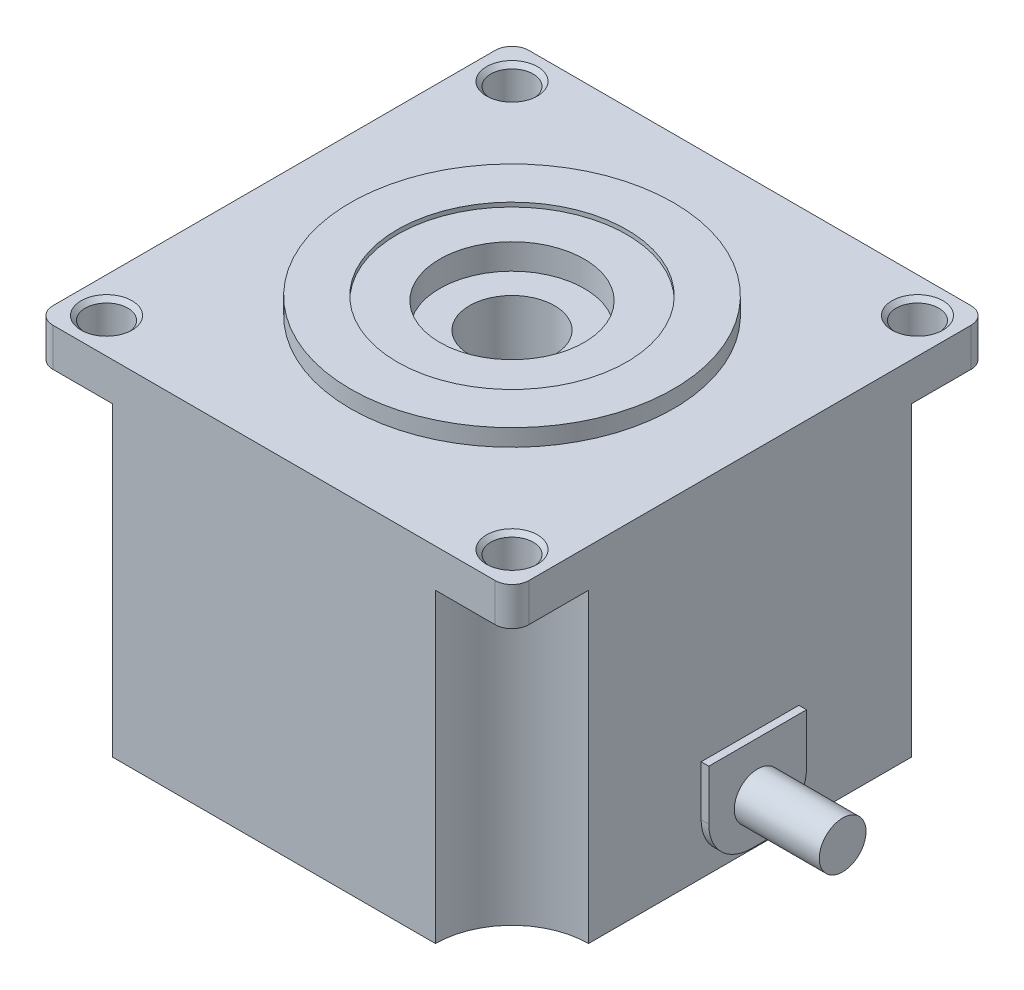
ISO-10303-21;
HEADER;
FILE_DESCRIPTION(('STEP AP214'),'2;1');
FILE_NAME('part.step','',(''),(''),'','','');
FILE_SCHEMA(('AUTOMOTIVE_DESIGN { 1 0 10303 214 1 1 1 1 }'));
ENDSEC;
DATA;
#1=APPLICATION_CONTEXT('core data for automotive mechanical design processes');
#2=APPLICATION_PROTOCOL_DEFINITION('international standard','automotive_design',2000,#1);
#3=PRODUCT_CONTEXT('',#1,'mechanical');
#4=PRODUCT('Part','Part','',(#3));
#5=PRODUCT_RELATED_PRODUCT_CATEGORY('part','',(#4));
#6=PRODUCT_DEFINITION_FORMATION('','',#4);
#7=PRODUCT_DEFINITION_CONTEXT('part definition',#1,'design');
#8=PRODUCT_DEFINITION('design','',#6,#7);
#9=PRODUCT_DEFINITION_SHAPE('','',#8);
#10=(LENGTH_UNIT() NAMED_UNIT(*) SI_UNIT(.MILLI.,.METRE.));
#11=(NAMED_UNIT(*) PLANE_ANGLE_UNIT() SI_UNIT($,.RADIAN.));
#12=(NAMED_UNIT(*) SI_UNIT($,.STERADIAN.) SOLID_ANGLE_UNIT());
#13=UNCERTAINTY_MEASURE_WITH_UNIT(LENGTH_MEASURE(1.E-05),#10,'distance_accuracy_value','');
#14=(GEOMETRIC_REPRESENTATION_CONTEXT(3) GLOBAL_UNCERTAINTY_ASSIGNED_CONTEXT((#13)) GLOBAL_UNIT_ASSIGNED_CONTEXT((#10,
#11,#12)) REPRESENTATION_CONTEXT('',''));
#15=CARTESIAN_POINT('',(0.,0.,0.));
#16=DIRECTION('',(0.,0.,1.));
#17=DIRECTION('',(1.,0.,0.));
#18=AXIS2_PLACEMENT_3D('',#15,#16,#17);
#19=CARTESIAN_POINT('',(28.8999999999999,6.00000000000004,-5.75));
#20=DIRECTION('',(0.,0.,1.));
#21=DIRECTION('',(0.,-1.,0.));
#22=AXIS2_PLACEMENT_3D('',#19,#20,#21);
#23=PLANE('',#22);
#24=DIRECTION('',(0.,1.,0.));
#25=VECTOR('',#24,1.);
#26=CARTESIAN_POINT('',(27.9999999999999,6.00000000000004,-5.75));
#27=LINE('',#26,#25);
#28=CARTESIAN_POINT('',(27.9999999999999,6.,-5.75));
#29=VERTEX_POINT('',#28);
#30=CARTESIAN_POINT('',(27.9999999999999,11.9,-5.75));
#31=VERTEX_POINT('',#30);
#32=EDGE_CURVE('E132',#29,#31,#27,.T.);
#33=ORIENTED_EDGE('',*,*,#32,.T.);
#34=DIRECTION('',(-1.,0.,0.));
#35=VECTOR('',#34,1.);
#36=CARTESIAN_POINT('',(28.8999999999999,11.9,-5.75));
#37=LINE('',#36,#35);
#38=CARTESIAN_POINT('',(28.8999999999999,11.9,-5.75));
#39=VERTEX_POINT('',#38);
#40=EDGE_CURVE('E55',#39,#31,#37,.T.);
#41=ORIENTED_EDGE('',*,*,#40,.F.);
#42=DIRECTION('',(0.,1.,0.));
#43=VECTOR('',#42,1.);
#44=CARTESIAN_POINT('',(28.8999999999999,6.00000000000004,-5.75));
#45=LINE('',#44,#43);
#46=CARTESIAN_POINT('',(28.8999999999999,6.,-5.75));
#47=VERTEX_POINT('',#46);
#48=EDGE_CURVE('E143',#47,#39,#45,.T.);
#49=ORIENTED_EDGE('',*,*,#48,.F.);
#50=DIRECTION('',(-1.,0.,0.));
#51=VECTOR('',#50,1.);
#52=CARTESIAN_POINT('',(28.8999999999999,6.,-5.75));
#53=LINE('',#52,#51);
#54=EDGE_CURVE('E128',#47,#29,#53,.T.);
#55=ORIENTED_EDGE('',*,*,#54,.T.);
#56=EDGE_LOOP('',(#33,#41,#49,#55));
#57=FACE_BOUND('',#56,.T.);
#58=ADVANCED_FACE('F47',(#57),#23,.F.);
#59=CARTESIAN_POINT('',(28.8999999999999,11.9,5.75));
#60=DIRECTION('',(0.,-1.,0.));
#61=DIRECTION('',(0.,0.,-1.));
#62=AXIS2_PLACEMENT_3D('',#59,#60,#61);
#63=PLANE('',#62);
#64=DIRECTION('',(0.,0.,1.));
#65=VECTOR('',#64,1.);
#66=CARTESIAN_POINT('',(27.9999999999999,11.9,5.75));
#67=LINE('',#66,#65);
#68=CARTESIAN_POINT('',(27.9999999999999,11.9,5.75));
#69=VERTEX_POINT('',#68);
#70=EDGE_CURVE('E135',#31,#69,#67,.T.);
#71=ORIENTED_EDGE('',*,*,#70,.T.);
#72=DIRECTION('',(-1.,0.,0.));
#73=VECTOR('',#72,1.);
#74=CARTESIAN_POINT('',(28.8999999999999,11.9,5.75));
#75=LINE('',#74,#73);
#76=CARTESIAN_POINT('',(28.8999999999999,11.9,5.75));
#77=VERTEX_POINT('',#76);
#78=EDGE_CURVE('E147',#77,#69,#75,.T.);
#79=ORIENTED_EDGE('',*,*,#78,.F.);
#80=DIRECTION('',(0.,0.,1.));
#81=VECTOR('',#80,1.);
#82=CARTESIAN_POINT('',(28.8999999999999,11.9,5.75));
#83=LINE('',#82,#81);
#84=EDGE_CURVE('E101',#39,#77,#83,.T.);
#85=ORIENTED_EDGE('',*,*,#84,.F.);
#86=ORIENTED_EDGE('',*,*,#40,.T.);
#87=EDGE_LOOP('',(#71,#79,#85,#86));
#88=FACE_BOUND('',#87,.T.);
#89=ADVANCED_FACE('F150',(#88),#63,.F.);
#90=CARTESIAN_POINT('',(28.8999999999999,6.00000000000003,5.75));
#91=DIRECTION('',(0.,0.,-1.));
#92=DIRECTION('',(0.,1.,0.));
#93=AXIS2_PLACEMENT_3D('',#90,#91,#92);
#94=PLANE('',#93);
#95=DIRECTION('',(0.,-1.,0.));
#96=VECTOR('',#95,1.);
#97=CARTESIAN_POINT('',(27.9999999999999,6.00000000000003,5.75));
#98=LINE('',#97,#96);
#99=CARTESIAN_POINT('',(27.9999999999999,6.00000000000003,5.75));
#100=VERTEX_POINT('',#99);
#101=EDGE_CURVE('E138',#69,#100,#98,.T.);
#102=ORIENTED_EDGE('',*,*,#101,.T.);
#103=DIRECTION('',(-1.,0.,0.));
#104=VECTOR('',#103,1.);
#105=CARTESIAN_POINT('',(28.8999999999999,6.00000000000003,5.75));
#106=LINE('',#105,#104);
#107=CARTESIAN_POINT('',(28.8999999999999,6.00000000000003,5.75));
#108=VERTEX_POINT('',#107);
#109=EDGE_CURVE('E123',#108,#100,#106,.T.);
#110=ORIENTED_EDGE('',*,*,#109,.F.);
#111=DIRECTION('',(0.,-1.,0.));
#112=VECTOR('',#111,1.);
#113=CARTESIAN_POINT('',(28.8999999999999,6.00000000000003,5.75));
#114=LINE('',#113,#112);
#115=EDGE_CURVE('E114',#77,#108,#114,.T.);
#116=ORIENTED_EDGE('',*,*,#115,.F.);
#117=ORIENTED_EDGE('',*,*,#78,.T.);
#118=EDGE_LOOP('',(#102,#110,#116,#117));
#119=FACE_BOUND('',#118,.T.);
#120=ADVANCED_FACE('F158',(#119),#94,.F.);
#121=CARTESIAN_POINT('',(28.8999999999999,6.,0.749999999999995));
#122=DIRECTION('',(-1.,0.,0.));
#123=DIRECTION('',(0.,0.,1.));
#124=AXIS2_PLACEMENT_3D('',#121,#122,#123);
#125=CYLINDRICAL_SURFACE('',#124,5.);
#126=CARTESIAN_POINT('',(27.9999999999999,6.,0.749999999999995));
#127=DIRECTION('',(1.,0.,0.));
#128=DIRECTION('',(0.,0.,1.));
#129=AXIS2_PLACEMENT_3D('',#126,#127,#128);
#130=CIRCLE('',#129,5.);
#131=CARTESIAN_POINT('',(27.9999999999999,1.,0.749999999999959));
#132=VERTEX_POINT('',#131);
#133=EDGE_CURVE('E122',#100,#132,#130,.T.);
#134=ORIENTED_EDGE('',*,*,#133,.T.);
#135=DIRECTION('',(-1.,0.,0.));
#136=VECTOR('',#135,1.);
#137=CARTESIAN_POINT('',(28.8999999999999,1.,0.749999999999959));
#138=LINE('',#137,#136);
#139=CARTESIAN_POINT('',(28.8999999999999,1.,0.749999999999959));
#140=VERTEX_POINT('',#139);
#141=EDGE_CURVE('E119',#140,#132,#138,.T.);
#142=ORIENTED_EDGE('',*,*,#141,.F.);
#143=CARTESIAN_POINT('',(28.8999999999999,6.,0.749999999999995));
#144=DIRECTION('',(1.,0.,0.));
#145=DIRECTION('',(0.,0.,1.));
#146=AXIS2_PLACEMENT_3D('',#143,#144,#145);
#147=CIRCLE('',#146,5.);
#148=EDGE_CURVE('E108',#108,#140,#147,.T.);
#149=ORIENTED_EDGE('',*,*,#148,.F.);
#150=ORIENTED_EDGE('',*,*,#109,.T.);
#151=EDGE_LOOP('',(#134,#142,#149,#150));
#152=FACE_BOUND('',#151,.T.);
#153=ADVANCED_FACE('F120',(#152),#125,.T.);
#154=CARTESIAN_POINT('',(28.8999999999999,1.,0.74999999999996));
#155=DIRECTION('',(0.,1.,0.));
#156=DIRECTION('',(0.,0.,1.));
#157=AXIS2_PLACEMENT_3D('',#154,#155,#156);
#158=PLANE('',#157);
#159=DIRECTION('',(0.,0.,-1.));
#160=VECTOR('',#159,1.);
#161=CARTESIAN_POINT('',(27.9999999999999,1.,0.74999999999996));
#162=LINE('',#161,#160);
#163=CARTESIAN_POINT('',(27.9999999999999,1.,-0.749999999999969));
#164=VERTEX_POINT('',#163);
#165=EDGE_CURVE('E86',#132,#164,#162,.T.);
#166=ORIENTED_EDGE('',*,*,#165,.T.);
#167=DIRECTION('',(-1.,0.,0.));
#168=VECTOR('',#167,1.);
#169=CARTESIAN_POINT('',(28.8999999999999,1.,-0.74999999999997));
#170=LINE('',#169,#168);
#171=CARTESIAN_POINT('',(28.8999999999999,1.,-0.74999999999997));
#172=VERTEX_POINT('',#171);
#173=EDGE_CURVE('E124',#172,#164,#170,.T.);
#174=ORIENTED_EDGE('',*,*,#173,.F.);
#175=DIRECTION('',(0.,0.,-1.));
#176=VECTOR('',#175,1.);
#177=CARTESIAN_POINT('',(28.8999999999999,1.,0.74999999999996));
#178=LINE('',#177,#176);
#179=EDGE_CURVE('E112',#140,#172,#178,.T.);
#180=ORIENTED_EDGE('',*,*,#179,.F.);
#181=ORIENTED_EDGE('',*,*,#141,.T.);
#182=EDGE_LOOP('',(#166,#174,#180,#181));
#183=FACE_BOUND('',#182,.T.);
#184=ADVANCED_FACE('F126',(#183),#158,.F.);
#185=CARTESIAN_POINT('',(28.8999999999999,6.,-0.750000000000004));
#186=DIRECTION('',(-1.,0.,0.));
#187=DIRECTION('',(0.,0.,1.));
#188=AXIS2_PLACEMENT_3D('',#185,#186,#187);
#189=CYLINDRICAL_SURFACE('',#188,5.);
#190=CARTESIAN_POINT('',(27.9999999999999,6.,-0.750000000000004));
#191=DIRECTION('',(1.,0.,0.));
#192=DIRECTION('',(0.,0.,-1.));
#193=AXIS2_PLACEMENT_3D('',#190,#191,#192);
#194=CIRCLE('',#193,5.);
#195=EDGE_CURVE('E92',#164,#29,#194,.T.);
#196=ORIENTED_EDGE('',*,*,#195,.T.);
#197=ORIENTED_EDGE('',*,*,#54,.F.);
#198=CARTESIAN_POINT('',(28.8999999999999,6.,-0.750000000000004));
#199=DIRECTION('',(1.,0.,0.));
#200=DIRECTION('',(0.,0.,-1.));
#201=AXIS2_PLACEMENT_3D('',#198,#199,#200);
#202=CIRCLE('',#201,5.);
#203=EDGE_CURVE('E63',#172,#47,#202,.T.);
#204=ORIENTED_EDGE('',*,*,#203,.F.);
#205=ORIENTED_EDGE('',*,*,#173,.T.);
#206=EDGE_LOOP('',(#196,#197,#204,#205));
#207=FACE_BOUND('',#206,.T.);
#208=ADVANCED_FACE('F174',(#207),#189,.T.);
#209=CARTESIAN_POINT('',(28.8999999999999,6.,0.749999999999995));
#210=DIRECTION('',(-1.,0.,0.));
#211=DIRECTION('',(0.,0.,1.));
#212=AXIS2_PLACEMENT_3D('',#209,#210,#211);
#213=PLANE('',#212);
#214=CARTESIAN_POINT('',(28.8999999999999,6.,0.));
#215=DIRECTION('',(-1.,0.,0.));
#216=DIRECTION('',(0.,0.,1.));
#217=AXIS2_PLACEMENT_3D('',#214,#215,#216);
#218=CIRCLE('',#217,2.75);
#219=CARTESIAN_POINT('',(28.8999999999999,6.,2.75));
#220=VERTEX_POINT('',#219);
#221=EDGE_CURVE('E12',#220,#220,#218,.F.);
#222=ORIENTED_EDGE('',*,*,#221,.F.);
#223=EDGE_LOOP('',(#222));
#224=FACE_BOUND('',#223,.T.);
#225=ORIENTED_EDGE('',*,*,#48,.T.);
#226=ORIENTED_EDGE('',*,*,#84,.T.);
#227=ORIENTED_EDGE('',*,*,#115,.T.);
#228=ORIENTED_EDGE('',*,*,#148,.T.);
#229=ORIENTED_EDGE('',*,*,#179,.T.);
#230=ORIENTED_EDGE('',*,*,#203,.T.);
#231=EDGE_LOOP('',(#225,#226,#227,#228,#229,#230));
#232=FACE_BOUND('',#231,.T.);
#233=ADVANCED_FACE('F110',(#224,#232),#213,.F.);
#234=CARTESIAN_POINT('',(27.9999999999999,6.,0.749999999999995));
#235=DIRECTION('',(-1.,0.,0.));
#236=DIRECTION('',(0.,0.,1.));
#237=AXIS2_PLACEMENT_3D('',#234,#235,#236);
#238=PLANE('',#237);
#239=ORIENTED_EDGE('',*,*,#32,.F.);
#240=ORIENTED_EDGE('',*,*,#195,.F.);
#241=ORIENTED_EDGE('',*,*,#165,.F.);
#242=ORIENTED_EDGE('',*,*,#133,.F.);
#243=ORIENTED_EDGE('',*,*,#101,.F.);
#244=ORIENTED_EDGE('',*,*,#70,.F.);
#245=EDGE_LOOP('',(#239,#240,#241,#242,#243,#244));
#246=FACE_BOUND('',#245,.T.);
#247=ADVANCED_FACE('F155',(#246),#238,.T.);
#248=CARTESIAN_POINT('',(38.8999999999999,6.,0.));
#249=DIRECTION('',(-1.,0.,0.));
#250=DIRECTION('',(0.,0.,1.));
#251=AXIS2_PLACEMENT_3D('',#248,#249,#250);
#252=CYLINDRICAL_SURFACE('',#251,2.75);
#253=CARTESIAN_POINT('',(38.8999999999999,6.,0.));
#254=DIRECTION('',(1.,0.,0.));
#255=DIRECTION('',(0.,0.,-1.));
#256=AXIS2_PLACEMENT_3D('',#253,#254,#255);
#257=CIRCLE('',#256,2.75);
#258=CARTESIAN_POINT('',(38.8999999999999,6.,-2.75000000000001));
#259=VERTEX_POINT('',#258);
#260=EDGE_CURVE('E136',#259,#259,#257,.T.);
#261=ORIENTED_EDGE('',*,*,#260,.F.);
#262=EDGE_LOOP('',(#261));
#263=FACE_BOUND('',#262,.T.);
#264=ORIENTED_EDGE('',*,*,#221,.T.);
#265=EDGE_LOOP('',(#264));
#266=FACE_BOUND('',#265,.T.);
#267=ADVANCED_FACE('F167',(#263,#266),#252,.T.);
#268=CARTESIAN_POINT('',(38.8999999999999,6.,0.));
#269=DIRECTION('',(1.,0.,0.));
#270=DIRECTION('',(0.,0.,-1.));
#271=AXIS2_PLACEMENT_3D('',#268,#269,#270);
#272=PLANE('',#271);
#273=ORIENTED_EDGE('',*,*,#260,.T.);
#274=EDGE_LOOP('',(#273));
#275=FACE_BOUND('',#274,.T.);
#276=ADVANCED_FACE('F165',(#275),#272,.T.);
#277=CLOSED_SHELL('',(#58,#89,#120,#153,#184,#208,#233,#247,#267,#276));
#278=MANIFOLD_SOLID_BREP('B2',#277);
#279=CARTESIAN_POINT('',(27.9999999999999,40.5,-28.0000000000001));
#280=DIRECTION('',(-1.,0.,0.));
#281=DIRECTION('',(0.,0.,1.));
#282=AXIS2_PLACEMENT_3D('',#279,#280,#281);
#283=PLANE('',#282);
#284=DIRECTION('',(0.,-1.,0.));
#285=VECTOR('',#284,1.);
#286=CARTESIAN_POINT('',(28.,40.5,26.));
#287=LINE('',#286,#285);
#288=CARTESIAN_POINT('',(28.,40.5,26.));
#289=VERTEX_POINT('',#288);
#290=CARTESIAN_POINT('',(28.,36.,26.));
#291=VERTEX_POINT('',#290);
#292=EDGE_CURVE('E512',#289,#291,#287,.T.);
#293=ORIENTED_EDGE('',*,*,#292,.T.);
#294=DIRECTION('',(0.,0.,1.));
#295=VECTOR('',#294,1.);
#296=CARTESIAN_POINT('',(27.9999999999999,36.,0.));
#297=LINE('',#296,#295);
#298=CARTESIAN_POINT('',(28.,36.,19.));
#299=VERTEX_POINT('',#298);
#300=EDGE_CURVE('E276',#299,#291,#297,.T.);
#301=ORIENTED_EDGE('',*,*,#300,.F.);
#302=DIRECTION('',(0.,-1.,0.));
#303=VECTOR('',#302,1.);
#304=CARTESIAN_POINT('',(28.,53.2279220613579,19.));
#305=LINE('',#304,#303);
#306=CARTESIAN_POINT('',(28.,0.,19.));
#307=VERTEX_POINT('',#306);
#308=EDGE_CURVE('E405',#299,#307,#305,.T.);
#309=ORIENTED_EDGE('',*,*,#308,.T.);
#310=DIRECTION('',(0.,0.,-1.));
#311=VECTOR('',#310,1.);
#312=CARTESIAN_POINT('',(27.9999999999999,0.,-28.0000000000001));
#313=LINE('',#312,#311);
#314=CARTESIAN_POINT('',(27.9999999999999,0.,-19.0000000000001));
#315=VERTEX_POINT('',#314);
#316=EDGE_CURVE('E470',#307,#315,#313,.T.);
#317=ORIENTED_EDGE('',*,*,#316,.T.);
#318=DIRECTION('',(0.,-1.,0.));
#319=VECTOR('',#318,1.);
#320=CARTESIAN_POINT('',(27.9999999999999,53.2279220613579,-19.0000000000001));
#321=LINE('',#320,#319);
#322=CARTESIAN_POINT('',(27.9999999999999,36.,-19.0000000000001));
#323=VERTEX_POINT('',#322);
#324=EDGE_CURVE('E403',#323,#315,#321,.T.);
#325=ORIENTED_EDGE('',*,*,#324,.F.);
#326=DIRECTION('',(0.,0.,1.));
#327=VECTOR('',#326,1.);
#328=CARTESIAN_POINT('',(27.9999999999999,36.,0.));
#329=LINE('',#328,#327);
#330=CARTESIAN_POINT('',(27.9999999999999,36.,-26.0000000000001));
#331=VERTEX_POINT('',#330);
#332=EDGE_CURVE('E422',#331,#323,#329,.T.);
#333=ORIENTED_EDGE('',*,*,#332,.F.);
#334=DIRECTION('',(0.,-1.,0.));
#335=VECTOR('',#334,1.);
#336=CARTESIAN_POINT('',(27.9999999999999,40.5,-26.0000000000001));
#337=LINE('',#336,#335);
#338=CARTESIAN_POINT('',(27.9999999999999,40.5,-26.0000000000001));
#339=VERTEX_POINT('',#338);
#340=EDGE_CURVE('E515',#331,#339,#337,.F.);
#341=ORIENTED_EDGE('',*,*,#340,.T.);
#342=DIRECTION('',(0.,0.,-1.));
#343=VECTOR('',#342,1.);
#344=CARTESIAN_POINT('',(27.9999999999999,40.5,-28.0000000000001));
#345=LINE('',#344,#343);
#346=EDGE_CURVE('E473',#289,#339,#345,.T.);
#347=ORIENTED_EDGE('',*,*,#346,.F.);
#348=EDGE_LOOP('',(#293,#301,#309,#317,#325,#333,#341,#347));
#349=FACE_BOUND('',#348,.T.);
#350=ADVANCED_FACE('F253',(#349),#283,.F.);
#351=CARTESIAN_POINT('',(-28.0000000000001,40.5,-28.0000000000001));
#352=DIRECTION('',(0.,0.,1.));
#353=DIRECTION('',(1.,0.,0.));
#354=AXIS2_PLACEMENT_3D('',#351,#352,#353);
#355=PLANE('',#354);
#356=DIRECTION('',(0.,-1.,0.));
#357=VECTOR('',#356,1.);
#358=CARTESIAN_POINT('',(25.9999999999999,40.5,-28.0000000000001));
#359=LINE('',#358,#357);
#360=CARTESIAN_POINT('',(25.9999999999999,40.5,-28.0000000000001));
#361=VERTEX_POINT('',#360);
#362=CARTESIAN_POINT('',(25.9999999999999,36.,-28.0000000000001));
#363=VERTEX_POINT('',#362);
#364=EDGE_CURVE('E499',#361,#363,#359,.T.);
#365=ORIENTED_EDGE('',*,*,#364,.T.);
#366=DIRECTION('',(1.,0.,0.));
#367=VECTOR('',#366,1.);
#368=CARTESIAN_POINT('',(0.,36.,-28.0000000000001));
#369=LINE('',#368,#367);
#370=CARTESIAN_POINT('',(18.9999999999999,36.,-28.0000000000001));
#371=VERTEX_POINT('',#370);
#372=EDGE_CURVE('E268',#371,#363,#369,.T.);
#373=ORIENTED_EDGE('',*,*,#372,.F.);
#374=DIRECTION('',(0.,-1.,0.));
#375=VECTOR('',#374,1.);
#376=CARTESIAN_POINT('',(18.9999999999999,53.2279220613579,-28.0000000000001));
#377=LINE('',#376,#375);
#378=CARTESIAN_POINT('',(18.9999999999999,0.,-28.0000000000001));
#379=VERTEX_POINT('',#378);
#380=EDGE_CURVE('E421',#371,#379,#377,.T.);
#381=ORIENTED_EDGE('',*,*,#380,.T.);
#382=DIRECTION('',(-1.,0.,0.));
#383=VECTOR('',#382,1.);
#384=CARTESIAN_POINT('',(-28.0000000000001,0.,-28.0000000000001));
#385=LINE('',#384,#383);
#386=CARTESIAN_POINT('',(-19.0000000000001,0.,-28.0000000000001));
#387=VERTEX_POINT('',#386);
#388=EDGE_CURVE('E489',#379,#387,#385,.T.);
#389=ORIENTED_EDGE('',*,*,#388,.T.);
#390=DIRECTION('',(0.,-1.,0.));
#391=VECTOR('',#390,1.);
#392=CARTESIAN_POINT('',(-19.0000000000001,53.2279220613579,-28.0000000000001));
#393=LINE('',#392,#391);
#394=CARTESIAN_POINT('',(-19.0000000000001,36.,-28.0000000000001));
#395=VERTEX_POINT('',#394);
#396=EDGE_CURVE('E439',#395,#387,#393,.T.);
#397=ORIENTED_EDGE('',*,*,#396,.F.);
#398=DIRECTION('',(1.,0.,0.));
#399=VECTOR('',#398,1.);
#400=CARTESIAN_POINT('',(0.,36.,-28.0000000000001));
#401=LINE('',#400,#399);
#402=CARTESIAN_POINT('',(-26.0000000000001,36.,-28.0000000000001));
#403=VERTEX_POINT('',#402);
#404=EDGE_CURVE('E436',#403,#395,#401,.T.);
#405=ORIENTED_EDGE('',*,*,#404,.F.);
#406=DIRECTION('',(0.,-1.,0.));
#407=VECTOR('',#406,1.);
#408=CARTESIAN_POINT('',(-26.0000000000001,40.5,-28.0000000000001));
#409=LINE('',#408,#407);
#410=CARTESIAN_POINT('',(-26.0000000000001,40.5,-28.0000000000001));
#411=VERTEX_POINT('',#410);
#412=EDGE_CURVE('E502',#403,#411,#409,.F.);
#413=ORIENTED_EDGE('',*,*,#412,.T.);
#414=DIRECTION('',(-1.,0.,0.));
#415=VECTOR('',#414,1.);
#416=CARTESIAN_POINT('',(-28.0000000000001,40.5,-28.0000000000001));
#417=LINE('',#416,#415);
#418=EDGE_CURVE('E476',#361,#411,#417,.T.);
#419=ORIENTED_EDGE('',*,*,#418,.F.);
#420=EDGE_LOOP('',(#365,#373,#381,#389,#397,#405,#413,#419));
#421=FACE_BOUND('',#420,.T.);
#422=ADVANCED_FACE('F555',(#421),#355,.F.);
#423=CARTESIAN_POINT('',(-28.0000000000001,40.5,-28.0000000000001));
#424=DIRECTION('',(1.,0.,0.));
#425=DIRECTION('',(0.,0.,-1.));
#426=AXIS2_PLACEMENT_3D('',#423,#424,#425);
#427=PLANE('',#426);
#428=DIRECTION('',(0.,-1.,0.));
#429=VECTOR('',#428,1.);
#430=CARTESIAN_POINT('',(-28.0000000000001,53.2279220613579,19.));
#431=LINE('',#430,#429);
#432=CARTESIAN_POINT('',(-28.0000000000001,36.,19.));
#433=VERTEX_POINT('',#432);
#434=CARTESIAN_POINT('',(-28.0000000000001,0.,19.));
#435=VERTEX_POINT('',#434);
#436=EDGE_CURVE('E397',#433,#435,#431,.T.);
#437=ORIENTED_EDGE('',*,*,#436,.F.);
#438=DIRECTION('',(0.,0.,-1.));
#439=VECTOR('',#438,1.);
#440=CARTESIAN_POINT('',(-28.0000000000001,36.,0.));
#441=LINE('',#440,#439);
#442=CARTESIAN_POINT('',(-28.0000000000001,36.,26.));
#443=VERTEX_POINT('',#442);
#444=EDGE_CURVE('E384',#443,#433,#441,.T.);
#445=ORIENTED_EDGE('',*,*,#444,.F.);
#446=DIRECTION('',(0.,-1.,0.));
#447=VECTOR('',#446,1.);
#448=CARTESIAN_POINT('',(-28.0000000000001,40.5,26.));
#449=LINE('',#448,#447);
#450=CARTESIAN_POINT('',(-28.0000000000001,40.5,26.));
#451=VERTEX_POINT('',#450);
#452=EDGE_CURVE('E486',#443,#451,#449,.F.);
#453=ORIENTED_EDGE('',*,*,#452,.T.);
#454=DIRECTION('',(0.,0.,1.));
#455=VECTOR('',#454,1.);
#456=CARTESIAN_POINT('',(-28.0000000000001,40.5,-28.0000000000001));
#457=LINE('',#456,#455);
#458=CARTESIAN_POINT('',(-28.0000000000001,40.5,-26.0000000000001));
#459=VERTEX_POINT('',#458);
#460=EDGE_CURVE('E480',#459,#451,#457,.T.);
#461=ORIENTED_EDGE('',*,*,#460,.F.);
#462=DIRECTION('',(0.,-1.,0.));
#463=VECTOR('',#462,1.);
#464=CARTESIAN_POINT('',(-28.0000000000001,40.5,-26.0000000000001));
#465=LINE('',#464,#463);
#466=CARTESIAN_POINT('',(-28.0000000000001,36.,-26.0000000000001));
#467=VERTEX_POINT('',#466);
#468=EDGE_CURVE('E496',#459,#467,#465,.T.);
#469=ORIENTED_EDGE('',*,*,#468,.T.);
#470=DIRECTION('',(0.,0.,-1.));
#471=VECTOR('',#470,1.);
#472=CARTESIAN_POINT('',(-28.0000000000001,36.,0.));
#473=LINE('',#472,#471);
#474=CARTESIAN_POINT('',(-28.0000000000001,36.,-19.0000000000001));
#475=VERTEX_POINT('',#474);
#476=EDGE_CURVE('E442',#475,#467,#473,.T.);
#477=ORIENTED_EDGE('',*,*,#476,.F.);
#478=DIRECTION('',(0.,-1.,0.));
#479=VECTOR('',#478,1.);
#480=CARTESIAN_POINT('',(-28.0000000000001,53.2279220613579,-19.0000000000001));
#481=LINE('',#480,#479);
#482=CARTESIAN_POINT('',(-28.0000000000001,0.,-19.0000000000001));
#483=VERTEX_POINT('',#482);
#484=EDGE_CURVE('E435',#475,#483,#481,.T.);
#485=ORIENTED_EDGE('',*,*,#484,.T.);
#486=DIRECTION('',(0.,0.,1.));
#487=VECTOR('',#486,1.);
#488=CARTESIAN_POINT('',(-28.0000000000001,0.,-28.0000000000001));
#489=LINE('',#488,#487);
#490=EDGE_CURVE('E491',#483,#435,#489,.T.);
#491=ORIENTED_EDGE('',*,*,#490,.T.);
#492=EDGE_LOOP('',(#437,#445,#453,#461,#469,#477,#485,#491));
#493=FACE_BOUND('',#492,.T.);
#494=ADVANCED_FACE('F561',(#493),#427,.F.);
#495=CARTESIAN_POINT('',(-28.0000000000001,40.5,28.));
#496=DIRECTION('',(0.,0.,-1.));
#497=DIRECTION('',(-1.,0.,0.));
#498=AXIS2_PLACEMENT_3D('',#495,#496,#497);
#499=PLANE('',#498);
#500=DIRECTION('',(0.,-1.,0.));
#501=VECTOR('',#500,1.);
#502=CARTESIAN_POINT('',(-26.,40.5,28.));
#503=LINE('',#502,#501);
#504=CARTESIAN_POINT('',(-26.,40.5,28.));
#505=VERTEX_POINT('',#504);
#506=CARTESIAN_POINT('',(-26.,36.,28.));
#507=VERTEX_POINT('',#506);
#508=EDGE_CURVE('E391',#505,#507,#503,.T.);
#509=ORIENTED_EDGE('',*,*,#508,.T.);
#510=DIRECTION('',(-1.,0.,0.));
#511=VECTOR('',#510,1.);
#512=CARTESIAN_POINT('',(0.,36.,28.));
#513=LINE('',#512,#511);
#514=CARTESIAN_POINT('',(-19.0000000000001,36.,28.));
#515=VERTEX_POINT('',#514);
#516=EDGE_CURVE('E378',#515,#507,#513,.T.);
#517=ORIENTED_EDGE('',*,*,#516,.F.);
#518=DIRECTION('',(0.,-1.,0.));
#519=VECTOR('',#518,1.);
#520=CARTESIAN_POINT('',(-19.0000000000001,53.2279220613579,28.));
#521=LINE('',#520,#519);
#522=CARTESIAN_POINT('',(-19.0000000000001,0.,28.));
#523=VERTEX_POINT('',#522);
#524=EDGE_CURVE('E367',#515,#523,#521,.T.);
#525=ORIENTED_EDGE('',*,*,#524,.T.);
#526=DIRECTION('',(1.,0.,0.));
#527=VECTOR('',#526,1.);
#528=CARTESIAN_POINT('',(-28.0000000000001,0.,28.));
#529=LINE('',#528,#527);
#530=CARTESIAN_POINT('',(18.9999999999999,0.,28.));
#531=VERTEX_POINT('',#530);
#532=EDGE_CURVE('E477',#523,#531,#529,.T.);
#533=ORIENTED_EDGE('',*,*,#532,.T.);
#534=DIRECTION('',(0.,-1.,0.));
#535=VECTOR('',#534,1.);
#536=CARTESIAN_POINT('',(18.9999999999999,53.2279220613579,28.));
#537=LINE('',#536,#535);
#538=CARTESIAN_POINT('',(18.9999999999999,36.,28.));
#539=VERTEX_POINT('',#538);
#540=EDGE_CURVE('E409',#539,#531,#537,.T.);
#541=ORIENTED_EDGE('',*,*,#540,.F.);
#542=DIRECTION('',(-1.,0.,0.));
#543=VECTOR('',#542,1.);
#544=CARTESIAN_POINT('',(0.,36.,28.));
#545=LINE('',#544,#543);
#546=CARTESIAN_POINT('',(25.9999999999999,36.,28.));
#547=VERTEX_POINT('',#546);
#548=EDGE_CURVE('E406',#547,#539,#545,.T.);
#549=ORIENTED_EDGE('',*,*,#548,.F.);
#550=DIRECTION('',(0.,-1.,0.));
#551=VECTOR('',#550,1.);
#552=CARTESIAN_POINT('',(25.9999999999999,40.5,28.));
#553=LINE('',#552,#551);
#554=CARTESIAN_POINT('',(25.9999999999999,40.5,28.));
#555=VERTEX_POINT('',#554);
#556=EDGE_CURVE('E518',#547,#555,#553,.F.);
#557=ORIENTED_EDGE('',*,*,#556,.T.);
#558=DIRECTION('',(1.,0.,0.));
#559=VECTOR('',#558,1.);
#560=CARTESIAN_POINT('',(-28.0000000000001,40.5,28.));
#561=LINE('',#560,#559);
#562=EDGE_CURVE('E483',#505,#555,#561,.T.);
#563=ORIENTED_EDGE('',*,*,#562,.F.);
#564=EDGE_LOOP('',(#509,#517,#525,#533,#541,#549,#557,#563));
#565=FACE_BOUND('',#564,.T.);
#566=ADVANCED_FACE('F388',(#565),#499,.F.);
#567=CARTESIAN_POINT('',(0.,40.5,0.));
#568=DIRECTION('',(0.,1.,0.));
#569=DIRECTION('',(0.,0.,1.));
#570=AXIS2_PLACEMENT_3D('',#567,#568,#569);
#571=PLANE('',#570);
#572=CARTESIAN_POINT('',(-23.85,40.5,23.8500000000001));
#573=DIRECTION('',(0.,1.,0.));
#574=DIRECTION('',(0.,0.,-1.));
#575=AXIS2_PLACEMENT_3D('',#572,#573,#574);
#576=CIRCLE('',#575,3.00000000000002);
#577=CARTESIAN_POINT('',(-23.85,40.5,20.8500000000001));
#578=VERTEX_POINT('',#577);
#579=EDGE_CURVE('E659',#578,#578,#576,.F.);
#580=ORIENTED_EDGE('',*,*,#579,.T.);
#581=EDGE_LOOP('',(#580));
#582=FACE_BOUND('',#581,.T.);
#583=CARTESIAN_POINT('',(-23.85,40.5,-23.8500000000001));
#584=DIRECTION('',(0.,1.,0.));
#585=DIRECTION('',(0.,0.,1.));
#586=AXIS2_PLACEMENT_3D('',#583,#584,#585);
#587=CIRCLE('',#586,3.00000000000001);
#588=CARTESIAN_POINT('',(-23.85,40.5,-20.8500000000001));
#589=VERTEX_POINT('',#588);
#590=EDGE_CURVE('E261',#589,#589,#587,.F.);
#591=ORIENTED_EDGE('',*,*,#590,.T.);
#592=EDGE_LOOP('',(#591));
#593=FACE_BOUND('',#592,.T.);
#594=CARTESIAN_POINT('',(23.85,40.5,23.8500000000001));
#595=DIRECTION('',(0.,-1.,0.));
#596=DIRECTION('',(0.,0.,-1.));
#597=AXIS2_PLACEMENT_3D('',#594,#595,#596);
#598=CIRCLE('',#597,3.00000000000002);
#599=CARTESIAN_POINT('',(23.85,40.5,20.8500000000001));
#600=VERTEX_POINT('',#599);
#601=EDGE_CURVE('E531',#600,#600,#598,.F.);
#602=ORIENTED_EDGE('',*,*,#601,.F.);
#603=EDGE_LOOP('',(#602));
#604=FACE_BOUND('',#603,.T.);
#605=CARTESIAN_POINT('',(23.85,40.5,-23.8500000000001));
#606=DIRECTION('',(0.,1.,0.));
#607=DIRECTION('',(0.,0.,1.));
#608=AXIS2_PLACEMENT_3D('',#605,#606,#607);
#609=CIRCLE('',#608,3.00000000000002);
#610=CARTESIAN_POINT('',(23.85,40.5,-20.8500000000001));
#611=VERTEX_POINT('',#610);
#612=EDGE_CURVE('E526',#611,#611,#609,.F.);
#613=ORIENTED_EDGE('',*,*,#612,.T.);
#614=EDGE_LOOP('',(#613));
#615=FACE_BOUND('',#614,.T.);
#616=CARTESIAN_POINT('',(0.,40.5,0.));
#617=DIRECTION('',(0.,1.,0.));
#618=DIRECTION('',(0.,0.,1.));
#619=AXIS2_PLACEMENT_3D('',#616,#617,#618);
#620=CIRCLE('',#619,19.);
#621=CARTESIAN_POINT('',(0.,40.5,19.));
#622=VERTEX_POINT('',#621);
#623=EDGE_CURVE('E464',#622,#622,#620,.T.);
#624=ORIENTED_EDGE('',*,*,#623,.F.);
#625=EDGE_LOOP('',(#624));
#626=FACE_BOUND('',#625,.T.);
#627=ORIENTED_EDGE('',*,*,#418,.T.);
#628=CARTESIAN_POINT('',(-26.0000000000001,40.5,-26.0000000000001));
#629=DIRECTION('',(0.,1.,0.));
#630=DIRECTION('',(0.,0.,1.));
#631=AXIS2_PLACEMENT_3D('',#628,#629,#630);
#632=CIRCLE('',#631,2.);
#633=EDGE_CURVE('E510',#411,#459,#632,.T.);
#634=ORIENTED_EDGE('',*,*,#633,.T.);
#635=ORIENTED_EDGE('',*,*,#460,.T.);
#636=CARTESIAN_POINT('',(-26.,40.5,26.));
#637=DIRECTION('',(0.,1.,0.));
#638=DIRECTION('',(0.,0.,1.));
#639=AXIS2_PLACEMENT_3D('',#636,#637,#638);
#640=CIRCLE('',#639,2.);
#641=EDGE_CURVE('E504',#451,#505,#640,.T.);
#642=ORIENTED_EDGE('',*,*,#641,.T.);
#643=ORIENTED_EDGE('',*,*,#562,.T.);
#644=CARTESIAN_POINT('',(25.9999999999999,40.5,26.));
#645=DIRECTION('',(0.,1.,0.));
#646=DIRECTION('',(0.,0.,1.));
#647=AXIS2_PLACEMENT_3D('',#644,#645,#646);
#648=CIRCLE('',#647,2.);
#649=EDGE_CURVE('E506',#555,#289,#648,.T.);
#650=ORIENTED_EDGE('',*,*,#649,.T.);
#651=ORIENTED_EDGE('',*,*,#346,.T.);
#652=CARTESIAN_POINT('',(25.9999999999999,40.5,-26.0000000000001));
#653=DIRECTION('',(0.,1.,0.));
#654=DIRECTION('',(0.,0.,1.));
#655=AXIS2_PLACEMENT_3D('',#652,#653,#654);
#656=CIRCLE('',#655,2.);
#657=EDGE_CURVE('E508',#339,#361,#656,.T.);
#658=ORIENTED_EDGE('',*,*,#657,.T.);
#659=EDGE_LOOP('',(#627,#634,#635,#642,#643,#650,#651,#658));
#660=FACE_BOUND('',#659,.T.);
#661=ADVANCED_FACE('F536',(#582,#593,#604,#615,#626,#660),#571,.T.);
#662=CARTESIAN_POINT('',(0.,0.,0.));
#663=DIRECTION('',(0.,1.,0.));
#664=DIRECTION('',(0.,0.,1.));
#665=AXIS2_PLACEMENT_3D('',#662,#663,#664);
#666=PLANE('',#665);
#667=CARTESIAN_POINT('',(0.,0.,0.));
#668=DIRECTION('',(0.,1.,0.));
#669=DIRECTION('',(0.,0.,1.));
#670=AXIS2_PLACEMENT_3D('',#667,#668,#669);
#671=CIRCLE('',#670,5.);
#672=CARTESIAN_POINT('',(0.,0.,5.));
#673=VERTEX_POINT('',#672);
#674=EDGE_CURVE('E449',#673,#673,#671,.T.);
#675=ORIENTED_EDGE('',*,*,#674,.T.);
#676=EDGE_LOOP('',(#675));
#677=FACE_BOUND('',#676,.T.);
#678=ORIENTED_EDGE('',*,*,#532,.F.);
#679=CARTESIAN_POINT('',(-28.0000000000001,0.,28.));
#680=DIRECTION('',(0.,-1.,0.));
#681=DIRECTION('',(0.,0.,-1.));
#682=AXIS2_PLACEMENT_3D('',#679,#680,#681);
#683=CIRCLE('',#682,9.);
#684=EDGE_CURVE('E373',#435,#523,#683,.T.);
#685=ORIENTED_EDGE('',*,*,#684,.F.);
#686=ORIENTED_EDGE('',*,*,#490,.F.);
#687=CARTESIAN_POINT('',(-28.0000000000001,0.,-28.0000000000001));
#688=DIRECTION('',(0.,-1.,0.));
#689=DIRECTION('',(0.,0.,-1.));
#690=AXIS2_PLACEMENT_3D('',#687,#688,#689);
#691=CIRCLE('',#690,9.);
#692=EDGE_CURVE('E399',#387,#483,#691,.T.);
#693=ORIENTED_EDGE('',*,*,#692,.F.);
#694=ORIENTED_EDGE('',*,*,#388,.F.);
#695=CARTESIAN_POINT('',(27.9999999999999,0.,-28.0000000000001));
#696=DIRECTION('',(0.,-1.,0.));
#697=DIRECTION('',(0.,0.,-1.));
#698=AXIS2_PLACEMENT_3D('',#695,#696,#697);
#699=CIRCLE('',#698,9.);
#700=EDGE_CURVE('E416',#315,#379,#699,.T.);
#701=ORIENTED_EDGE('',*,*,#700,.F.);
#702=ORIENTED_EDGE('',*,*,#316,.F.);
#703=CARTESIAN_POINT('',(28.,0.,28.));
#704=DIRECTION('',(0.,-1.,0.));
#705=DIRECTION('',(0.,0.,-1.));
#706=AXIS2_PLACEMENT_3D('',#703,#704,#705);
#707=CIRCLE('',#706,9.);
#708=EDGE_CURVE('E400',#531,#307,#707,.T.);
#709=ORIENTED_EDGE('',*,*,#708,.F.);
#710=EDGE_LOOP('',(#678,#685,#686,#693,#694,#701,#702,#709));
#711=FACE_BOUND('',#710,.T.);
#712=ADVANCED_FACE('F570',(#677,#711),#666,.F.);
#713=CARTESIAN_POINT('',(-26.0000000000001,40.5,-26.0000000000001));
#714=DIRECTION('',(0.,-1.,0.));
#715=DIRECTION('',(0.,0.,-1.));
#716=AXIS2_PLACEMENT_3D('',#713,#714,#715);
#717=CYLINDRICAL_SURFACE('',#716,2.);
#718=CARTESIAN_POINT('',(-26.0000000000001,36.,-26.0000000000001));
#719=DIRECTION('',(0.,1.,0.));
#720=DIRECTION('',(0.,0.,1.));
#721=AXIS2_PLACEMENT_3D('',#718,#719,#720);
#722=CIRCLE('',#721,2.);
#723=EDGE_CURVE('E440',#467,#403,#722,.F.);
#724=ORIENTED_EDGE('',*,*,#723,.F.);
#725=ORIENTED_EDGE('',*,*,#468,.F.);
#726=ORIENTED_EDGE('',*,*,#633,.F.);
#727=ORIENTED_EDGE('',*,*,#412,.F.);
#728=EDGE_LOOP('',(#724,#725,#726,#727));
#729=FACE_BOUND('',#728,.T.);
#730=ADVANCED_FACE('F566',(#729),#717,.T.);
#731=CARTESIAN_POINT('',(25.9999999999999,40.5,-26.0000000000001));
#732=DIRECTION('',(0.,-1.,0.));
#733=DIRECTION('',(0.,0.,-1.));
#734=AXIS2_PLACEMENT_3D('',#731,#732,#733);
#735=CYLINDRICAL_SURFACE('',#734,2.);
#736=CARTESIAN_POINT('',(25.9999999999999,36.,-26.0000000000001));
#737=DIRECTION('',(0.,1.,0.));
#738=DIRECTION('',(0.,0.,1.));
#739=AXIS2_PLACEMENT_3D('',#736,#737,#738);
#740=CIRCLE('',#739,2.);
#741=EDGE_CURVE('E425',#363,#331,#740,.F.);
#742=ORIENTED_EDGE('',*,*,#741,.F.);
#743=ORIENTED_EDGE('',*,*,#364,.F.);
#744=ORIENTED_EDGE('',*,*,#657,.F.);
#745=ORIENTED_EDGE('',*,*,#340,.F.);
#746=EDGE_LOOP('',(#742,#743,#744,#745));
#747=FACE_BOUND('',#746,.T.);
#748=ADVANCED_FACE('F569',(#747),#735,.T.);
#749=CARTESIAN_POINT('',(25.9999999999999,40.5,26.));
#750=DIRECTION('',(0.,-1.,0.));
#751=DIRECTION('',(0.,0.,-1.));
#752=AXIS2_PLACEMENT_3D('',#749,#750,#751);
#753=CYLINDRICAL_SURFACE('',#752,2.);
#754=CARTESIAN_POINT('',(25.9999999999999,36.,26.));
#755=DIRECTION('',(0.,1.,0.));
#756=DIRECTION('',(0.,0.,1.));
#757=AXIS2_PLACEMENT_3D('',#754,#755,#756);
#758=CIRCLE('',#757,2.);
#759=EDGE_CURVE('E410',#291,#547,#758,.F.);
#760=ORIENTED_EDGE('',*,*,#759,.F.);
#761=ORIENTED_EDGE('',*,*,#292,.F.);
#762=ORIENTED_EDGE('',*,*,#649,.F.);
#763=ORIENTED_EDGE('',*,*,#556,.F.);
#764=EDGE_LOOP('',(#760,#761,#762,#763));
#765=FACE_BOUND('',#764,.T.);
#766=ADVANCED_FACE('F574',(#765),#753,.T.);
#767=CARTESIAN_POINT('',(-26.,40.5,26.));
#768=DIRECTION('',(0.,-1.,0.));
#769=DIRECTION('',(0.,0.,-1.));
#770=AXIS2_PLACEMENT_3D('',#767,#768,#769);
#771=CYLINDRICAL_SURFACE('',#770,2.);
#772=CARTESIAN_POINT('',(-26.,36.,26.));
#773=DIRECTION('',(0.,1.,0.));
#774=DIRECTION('',(0.,0.,1.));
#775=AXIS2_PLACEMENT_3D('',#772,#773,#774);
#776=CIRCLE('',#775,2.);
#777=EDGE_CURVE('E392',#507,#443,#776,.F.);
#778=ORIENTED_EDGE('',*,*,#777,.F.);
#779=ORIENTED_EDGE('',*,*,#508,.F.);
#780=ORIENTED_EDGE('',*,*,#641,.F.);
#781=ORIENTED_EDGE('',*,*,#452,.F.);
#782=EDGE_LOOP('',(#778,#779,#780,#781));
#783=FACE_BOUND('',#782,.T.);
#784=ADVANCED_FACE('F578',(#783),#771,.T.);
#785=CARTESIAN_POINT('',(0.,42.5,0.));
#786=DIRECTION('',(0.,-1.,0.));
#787=DIRECTION('',(0.,0.,-1.));
#788=AXIS2_PLACEMENT_3D('',#785,#786,#787);
#789=CYLINDRICAL_SURFACE('',#788,19.);
#790=CARTESIAN_POINT('',(0.,42.5,0.));
#791=DIRECTION('',(0.,1.,0.));
#792=DIRECTION('',(0.,0.,1.));
#793=AXIS2_PLACEMENT_3D('',#790,#791,#792);
#794=CIRCLE('',#793,19.);
#795=CARTESIAN_POINT('',(0.,42.5,19.));
#796=VERTEX_POINT('',#795);
#797=EDGE_CURVE('E467',#796,#796,#794,.T.);
#798=ORIENTED_EDGE('',*,*,#797,.F.);
#799=EDGE_LOOP('',(#798));
#800=FACE_BOUND('',#799,.T.);
#801=ORIENTED_EDGE('',*,*,#623,.T.);
#802=EDGE_LOOP('',(#801));
#803=FACE_BOUND('',#802,.T.);
#804=ADVANCED_FACE('F581',(#800,#803),#789,.T.);
#805=CARTESIAN_POINT('',(0.,42.5,0.));
#806=DIRECTION('',(0.,1.,0.));
#807=DIRECTION('',(0.,0.,1.));
#808=AXIS2_PLACEMENT_3D('',#805,#806,#807);
#809=PLANE('',#808);
#810=CARTESIAN_POINT('',(0.,42.5,0.));
#811=DIRECTION('',(0.,1.,0.));
#812=DIRECTION('',(0.,0.,1.));
#813=AXIS2_PLACEMENT_3D('',#810,#811,#812);
#814=CIRCLE('',#813,13.5);
#815=CARTESIAN_POINT('',(0.,42.5,13.5));
#816=VERTEX_POINT('',#815);
#817=EDGE_CURVE('E458',#816,#816,#814,.T.);
#818=ORIENTED_EDGE('',*,*,#817,.F.);
#819=EDGE_LOOP('',(#818));
#820=FACE_BOUND('',#819,.T.);
#821=ORIENTED_EDGE('',*,*,#797,.T.);
#822=EDGE_LOOP('',(#821));
#823=FACE_BOUND('',#822,.T.);
#824=ADVANCED_FACE('F709',(#820,#823),#809,.T.);
#825=CARTESIAN_POINT('',(0.,42.,0.));
#826=DIRECTION('',(0.,1.,0.));
#827=DIRECTION('',(0.,0.,1.));
#828=AXIS2_PLACEMENT_3D('',#825,#826,#827);
#829=CYLINDRICAL_SURFACE('',#828,13.5);
#830=CARTESIAN_POINT('',(0.,42.,0.));
#831=DIRECTION('',(0.,1.,0.));
#832=DIRECTION('',(0.,0.,1.));
#833=AXIS2_PLACEMENT_3D('',#830,#831,#832);
#834=CIRCLE('',#833,13.5);
#835=CARTESIAN_POINT('',(0.,42.,13.5));
#836=VERTEX_POINT('',#835);
#837=EDGE_CURVE('E461',#836,#836,#834,.T.);
#838=ORIENTED_EDGE('',*,*,#837,.F.);
#839=EDGE_LOOP('',(#838));
#840=FACE_BOUND('',#839,.T.);
#841=ORIENTED_EDGE('',*,*,#817,.T.);
#842=EDGE_LOOP('',(#841));
#843=FACE_BOUND('',#842,.T.);
#844=ADVANCED_FACE('F705',(#840,#843),#829,.F.);
#845=CARTESIAN_POINT('',(0.,42.,0.));
#846=DIRECTION('',(0.,1.,0.));
#847=DIRECTION('',(0.,0.,1.));
#848=AXIS2_PLACEMENT_3D('',#845,#846,#847);
#849=PLANE('',#848);
#850=CARTESIAN_POINT('',(0.,42.,0.));
#851=DIRECTION('',(0.,1.,0.));
#852=DIRECTION('',(0.,0.,1.));
#853=AXIS2_PLACEMENT_3D('',#850,#851,#852);
#854=CIRCLE('',#853,8.5);
#855=CARTESIAN_POINT('',(0.,42.,8.5));
#856=VERTEX_POINT('',#855);
#857=EDGE_CURVE('E452',#856,#856,#854,.T.);
#858=ORIENTED_EDGE('',*,*,#857,.F.);
#859=EDGE_LOOP('',(#858));
#860=FACE_BOUND('',#859,.T.);
#861=ORIENTED_EDGE('',*,*,#837,.T.);
#862=EDGE_LOOP('',(#861));
#863=FACE_BOUND('',#862,.T.);
#864=ADVANCED_FACE('F701',(#860,#863),#849,.T.);
#865=CARTESIAN_POINT('',(0.,39.,0.));
#866=DIRECTION('',(0.,1.,0.));
#867=DIRECTION('',(0.,0.,1.));
#868=AXIS2_PLACEMENT_3D('',#865,#866,#867);
#869=CYLINDRICAL_SURFACE('',#868,8.5);
#870=CARTESIAN_POINT('',(0.,39.,0.));
#871=DIRECTION('',(0.,1.,0.));
#872=DIRECTION('',(0.,0.,1.));
#873=AXIS2_PLACEMENT_3D('',#870,#871,#872);
#874=CIRCLE('',#873,8.5);
#875=CARTESIAN_POINT('',(0.,39.,8.5));
#876=VERTEX_POINT('',#875);
#877=EDGE_CURVE('E455',#876,#876,#874,.T.);
#878=ORIENTED_EDGE('',*,*,#877,.F.);
#879=EDGE_LOOP('',(#878));
#880=FACE_BOUND('',#879,.T.);
#881=ORIENTED_EDGE('',*,*,#857,.T.);
#882=EDGE_LOOP('',(#881));
#883=FACE_BOUND('',#882,.T.);
#884=ADVANCED_FACE('F697',(#880,#883),#869,.F.);
#885=CARTESIAN_POINT('',(0.,39.,0.));
#886=DIRECTION('',(0.,1.,0.));
#887=DIRECTION('',(0.,0.,1.));
#888=AXIS2_PLACEMENT_3D('',#885,#886,#887);
#889=PLANE('',#888);
#890=CARTESIAN_POINT('',(0.,39.,0.));
#891=DIRECTION('',(0.,1.,0.));
#892=DIRECTION('',(0.,0.,1.));
#893=AXIS2_PLACEMENT_3D('',#890,#891,#892);
#894=CIRCLE('',#893,5.);
#895=CARTESIAN_POINT('',(0.,39.,5.));
#896=VERTEX_POINT('',#895);
#897=EDGE_CURVE('E448',#896,#896,#894,.T.);
#898=ORIENTED_EDGE('',*,*,#897,.F.);
#899=EDGE_LOOP('',(#898));
#900=FACE_BOUND('',#899,.T.);
#901=ORIENTED_EDGE('',*,*,#877,.T.);
#902=EDGE_LOOP('',(#901));
#903=FACE_BOUND('',#902,.T.);
#904=ADVANCED_FACE('F693',(#900,#903),#889,.T.);
#905=CARTESIAN_POINT('',(0.,0.,0.));
#906=DIRECTION('',(0.,1.,0.));
#907=DIRECTION('',(0.,0.,1.));
#908=AXIS2_PLACEMENT_3D('',#905,#906,#907);
#909=CYLINDRICAL_SURFACE('',#908,5.);
#910=ORIENTED_EDGE('',*,*,#674,.F.);
#911=EDGE_LOOP('',(#910));
#912=FACE_BOUND('',#911,.T.);
#913=ORIENTED_EDGE('',*,*,#897,.T.);
#914=EDGE_LOOP('',(#913));
#915=FACE_BOUND('',#914,.T.);
#916=ADVANCED_FACE('F689',(#912,#915),#909,.F.);
#917=CARTESIAN_POINT('',(0.,36.,0.));
#918=DIRECTION('',(0.,1.,0.));
#919=DIRECTION('',(0.,0.,1.));
#920=AXIS2_PLACEMENT_3D('',#917,#918,#919);
#921=PLANE('',#920);
#922=CARTESIAN_POINT('',(-23.85,36.,-23.8500000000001));
#923=DIRECTION('',(0.,1.,0.));
#924=DIRECTION('',(0.,0.,1.));
#925=AXIS2_PLACEMENT_3D('',#922,#923,#924);
#926=CIRCLE('',#925,2.5);
#927=CARTESIAN_POINT('',(-23.85,36.,-21.3500000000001));
#928=VERTEX_POINT('',#927);
#929=EDGE_CURVE('E529',#928,#928,#926,.F.);
#930=ORIENTED_EDGE('',*,*,#929,.F.);
#931=EDGE_LOOP('',(#930));
#932=FACE_BOUND('',#931,.T.);
#933=ORIENTED_EDGE('',*,*,#404,.T.);
#934=CARTESIAN_POINT('',(-28.0000000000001,36.,-28.0000000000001));
#935=DIRECTION('',(0.,1.,0.));
#936=DIRECTION('',(0.,0.,1.));
#937=AXIS2_PLACEMENT_3D('',#934,#935,#936);
#938=CIRCLE('',#937,9.);
#939=EDGE_CURVE('E432',#395,#475,#938,.F.);
#940=ORIENTED_EDGE('',*,*,#939,.T.);
#941=ORIENTED_EDGE('',*,*,#476,.T.);
#942=ORIENTED_EDGE('',*,*,#723,.T.);
#943=EDGE_LOOP('',(#933,#940,#941,#942));
#944=FACE_BOUND('',#943,.T.);
#945=ADVANCED_FACE('F624',(#932,#944),#921,.F.);
#946=CARTESIAN_POINT('',(-28.0000000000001,53.2279220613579,-28.0000000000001));
#947=DIRECTION('',(0.,-1.,0.));
#948=DIRECTION('',(0.,0.,-1.));
#949=AXIS2_PLACEMENT_3D('',#946,#947,#948);
#950=CYLINDRICAL_SURFACE('',#949,9.);
#951=ORIENTED_EDGE('',*,*,#396,.T.);
#952=ORIENTED_EDGE('',*,*,#692,.T.);
#953=ORIENTED_EDGE('',*,*,#484,.F.);
#954=ORIENTED_EDGE('',*,*,#939,.F.);
#955=EDGE_LOOP('',(#951,#952,#953,#954));
#956=FACE_BOUND('',#955,.T.);
#957=ADVANCED_FACE('F621',(#956),#950,.F.);
#958=CARTESIAN_POINT('',(0.,36.,0.));
#959=DIRECTION('',(0.,1.,0.));
#960=DIRECTION('',(0.,0.,1.));
#961=AXIS2_PLACEMENT_3D('',#958,#959,#960);
#962=PLANE('',#961);
#963=CARTESIAN_POINT('',(-23.85,36.,23.8500000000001));
#964=DIRECTION('',(0.,1.,0.));
#965=DIRECTION('',(0.,0.,-1.));
#966=AXIS2_PLACEMENT_3D('',#963,#964,#965);
#967=CIRCLE('',#966,2.5);
#968=CARTESIAN_POINT('',(-23.85,36.,21.3500000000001));
#969=VERTEX_POINT('',#968);
#970=EDGE_CURVE('E656',#969,#969,#967,.T.);
#971=ORIENTED_EDGE('',*,*,#970,.T.);
#972=EDGE_LOOP('',(#971));
#973=FACE_BOUND('',#972,.T.);
#974=ORIENTED_EDGE('',*,*,#444,.T.);
#975=CARTESIAN_POINT('',(-28.0000000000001,36.,28.));
#976=DIRECTION('',(0.,1.,0.));
#977=DIRECTION('',(0.,0.,1.));
#978=AXIS2_PLACEMENT_3D('',#975,#976,#977);
#979=CIRCLE('',#978,9.);
#980=EDGE_CURVE('E370',#433,#515,#979,.F.);
#981=ORIENTED_EDGE('',*,*,#980,.T.);
#982=ORIENTED_EDGE('',*,*,#516,.T.);
#983=ORIENTED_EDGE('',*,*,#777,.T.);
#984=EDGE_LOOP('',(#974,#981,#982,#983));
#985=FACE_BOUND('',#984,.T.);
#986=ADVANCED_FACE('F381',(#973,#985),#962,.F.);
#987=CARTESIAN_POINT('',(-28.0000000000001,53.2279220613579,28.));
#988=DIRECTION('',(0.,-1.,0.));
#989=DIRECTION('',(0.,0.,-1.));
#990=AXIS2_PLACEMENT_3D('',#987,#988,#989);
#991=CYLINDRICAL_SURFACE('',#990,9.);
#992=ORIENTED_EDGE('',*,*,#436,.T.);
#993=ORIENTED_EDGE('',*,*,#684,.T.);
#994=ORIENTED_EDGE('',*,*,#524,.F.);
#995=ORIENTED_EDGE('',*,*,#980,.F.);
#996=EDGE_LOOP('',(#992,#993,#994,#995));
#997=FACE_BOUND('',#996,.T.);
#998=ADVANCED_FACE('F369',(#997),#991,.F.);
#999=CARTESIAN_POINT('',(0.,36.,0.));
#1000=DIRECTION('',(0.,1.,0.));
#1001=DIRECTION('',(0.,0.,1.));
#1002=AXIS2_PLACEMENT_3D('',#999,#1000,#1001);
#1003=PLANE('',#1002);
#1004=CARTESIAN_POINT('',(23.85,36.,23.8500000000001));
#1005=DIRECTION('',(0.,-1.,0.));
#1006=DIRECTION('',(0.,0.,-1.));
#1007=AXIS2_PLACEMENT_3D('',#1004,#1005,#1006);
#1008=CIRCLE('',#1007,2.5);
#1009=CARTESIAN_POINT('',(23.85,36.,21.3500000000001));
#1010=VERTEX_POINT('',#1009);
#1011=EDGE_CURVE('E649',#1010,#1010,#1008,.T.);
#1012=ORIENTED_EDGE('',*,*,#1011,.F.);
#1013=EDGE_LOOP('',(#1012));
#1014=FACE_BOUND('',#1013,.T.);
#1015=ORIENTED_EDGE('',*,*,#548,.T.);
#1016=CARTESIAN_POINT('',(28.,36.,28.));
#1017=DIRECTION('',(0.,1.,0.));
#1018=DIRECTION('',(0.,0.,1.));
#1019=AXIS2_PLACEMENT_3D('',#1016,#1017,#1018);
#1020=CIRCLE('',#1019,9.);
#1021=EDGE_CURVE('E402',#539,#299,#1020,.F.);
#1022=ORIENTED_EDGE('',*,*,#1021,.T.);
#1023=ORIENTED_EDGE('',*,*,#300,.T.);
#1024=ORIENTED_EDGE('',*,*,#759,.T.);
#1025=EDGE_LOOP('',(#1015,#1022,#1023,#1024));
#1026=FACE_BOUND('',#1025,.T.);
#1027=ADVANCED_FACE('F644',(#1014,#1026),#1003,.F.);
#1028=CARTESIAN_POINT('',(28.,53.2279220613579,28.));
#1029=DIRECTION('',(0.,-1.,0.));
#1030=DIRECTION('',(0.,0.,-1.));
#1031=AXIS2_PLACEMENT_3D('',#1028,#1029,#1030);
#1032=CYLINDRICAL_SURFACE('',#1031,9.);
#1033=ORIENTED_EDGE('',*,*,#540,.T.);
#1034=ORIENTED_EDGE('',*,*,#708,.T.);
#1035=ORIENTED_EDGE('',*,*,#308,.F.);
#1036=ORIENTED_EDGE('',*,*,#1021,.F.);
#1037=EDGE_LOOP('',(#1033,#1034,#1035,#1036));
#1038=FACE_BOUND('',#1037,.T.);
#1039=ADVANCED_FACE('F605',(#1038),#1032,.F.);
#1040=CARTESIAN_POINT('',(0.,36.,0.));
#1041=DIRECTION('',(0.,1.,0.));
#1042=DIRECTION('',(0.,0.,1.));
#1043=AXIS2_PLACEMENT_3D('',#1040,#1041,#1042);
#1044=PLANE('',#1043);
#1045=CARTESIAN_POINT('',(23.85,36.,-23.8500000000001));
#1046=DIRECTION('',(0.,1.,0.));
#1047=DIRECTION('',(0.,0.,1.));
#1048=AXIS2_PLACEMENT_3D('',#1045,#1046,#1047);
#1049=CIRCLE('',#1048,2.5);
#1050=CARTESIAN_POINT('',(23.85,36.,-21.3500000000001));
#1051=VERTEX_POINT('',#1050);
#1052=EDGE_CURVE('E419',#1051,#1051,#1049,.T.);
#1053=ORIENTED_EDGE('',*,*,#1052,.T.);
#1054=EDGE_LOOP('',(#1053));
#1055=FACE_BOUND('',#1054,.T.);
#1056=ORIENTED_EDGE('',*,*,#332,.T.);
#1057=CARTESIAN_POINT('',(27.9999999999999,36.,-28.0000000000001));
#1058=DIRECTION('',(0.,1.,0.));
#1059=DIRECTION('',(0.,0.,1.));
#1060=AXIS2_PLACEMENT_3D('',#1057,#1058,#1059);
#1061=CIRCLE('',#1060,9.);
#1062=EDGE_CURVE('E418',#323,#371,#1061,.F.);
#1063=ORIENTED_EDGE('',*,*,#1062,.T.);
#1064=ORIENTED_EDGE('',*,*,#372,.T.);
#1065=ORIENTED_EDGE('',*,*,#741,.T.);
#1066=EDGE_LOOP('',(#1056,#1063,#1064,#1065));
#1067=FACE_BOUND('',#1066,.T.);
#1068=ADVANCED_FACE('F603',(#1055,#1067),#1044,.F.);
#1069=CARTESIAN_POINT('',(27.9999999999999,53.2279220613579,-28.0000000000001));
#1070=DIRECTION('',(0.,-1.,0.));
#1071=DIRECTION('',(0.,0.,-1.));
#1072=AXIS2_PLACEMENT_3D('',#1069,#1070,#1071);
#1073=CYLINDRICAL_SURFACE('',#1072,9.);
#1074=ORIENTED_EDGE('',*,*,#324,.T.);
#1075=ORIENTED_EDGE('',*,*,#700,.T.);
#1076=ORIENTED_EDGE('',*,*,#380,.F.);
#1077=ORIENTED_EDGE('',*,*,#1062,.F.);
#1078=EDGE_LOOP('',(#1074,#1075,#1076,#1077));
#1079=FACE_BOUND('',#1078,.T.);
#1080=ADVANCED_FACE('F594',(#1079),#1073,.F.);
#1081=CARTESIAN_POINT('',(23.85,0.,-23.8500000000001));
#1082=DIRECTION('',(0.,1.,0.));
#1083=DIRECTION('',(0.,0.,1.));
#1084=AXIS2_PLACEMENT_3D('',#1081,#1082,#1083);
#1085=CYLINDRICAL_SURFACE('',#1084,2.5);
#1086=CARTESIAN_POINT('',(23.85,40.,-23.8500000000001));
#1087=DIRECTION('',(0.,1.,0.));
#1088=DIRECTION('',(0.,0.,1.));
#1089=AXIS2_PLACEMENT_3D('',#1086,#1087,#1088);
#1090=CIRCLE('',#1089,2.5);
#1091=CARTESIAN_POINT('',(23.85,40.,-21.3500000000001));
#1092=VERTEX_POINT('',#1091);
#1093=EDGE_CURVE('E520',#1092,#1092,#1090,.T.);
#1094=ORIENTED_EDGE('',*,*,#1093,.T.);
#1095=EDGE_LOOP('',(#1094));
#1096=FACE_BOUND('',#1095,.T.);
#1097=ORIENTED_EDGE('',*,*,#1052,.F.);
#1098=EDGE_LOOP('',(#1097));
#1099=FACE_BOUND('',#1098,.T.);
#1100=ADVANCED_FACE('F586',(#1096,#1099),#1085,.F.);
#1101=CARTESIAN_POINT('',(23.85,40.,-23.8500000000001));
#1102=DIRECTION('',(0.,1.,0.));
#1103=DIRECTION('',(0.,0.,1.));
#1104=AXIS2_PLACEMENT_3D('',#1101,#1102,#1103);
#1105=CONICAL_SURFACE('',#1104,2.5,0.785398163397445);
#1106=ORIENTED_EDGE('',*,*,#612,.F.);
#1107=EDGE_LOOP('',(#1106));
#1108=FACE_BOUND('',#1107,.T.);
#1109=ORIENTED_EDGE('',*,*,#1093,.F.);
#1110=EDGE_LOOP('',(#1109));
#1111=FACE_BOUND('',#1110,.T.);
#1112=ADVANCED_FACE('F583',(#1108,#1111),#1105,.F.);
#1113=CARTESIAN_POINT('',(23.85,0.,23.8500000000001));
#1114=DIRECTION('',(0.,1.,0.));
#1115=DIRECTION('',(0.,0.,-1.));
#1116=AXIS2_PLACEMENT_3D('',#1113,#1114,#1115);
#1117=CYLINDRICAL_SURFACE('',#1116,2.5);
#1118=CARTESIAN_POINT('',(23.85,40.,23.8500000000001));
#1119=DIRECTION('',(0.,-1.,0.));
#1120=DIRECTION('',(0.,0.,-1.));
#1121=AXIS2_PLACEMENT_3D('',#1118,#1119,#1120);
#1122=CIRCLE('',#1121,2.5);
#1123=CARTESIAN_POINT('',(23.85,40.,21.3500000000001));
#1124=VERTEX_POINT('',#1123);
#1125=EDGE_CURVE('E523',#1124,#1124,#1122,.T.);
#1126=ORIENTED_EDGE('',*,*,#1125,.F.);
#1127=EDGE_LOOP('',(#1126));
#1128=FACE_BOUND('',#1127,.T.);
#1129=ORIENTED_EDGE('',*,*,#1011,.T.);
#1130=EDGE_LOOP('',(#1129));
#1131=FACE_BOUND('',#1130,.T.);
#1132=ADVANCED_FACE('F585',(#1128,#1131),#1117,.F.);
#1133=CARTESIAN_POINT('',(23.85,40.,23.8500000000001));
#1134=DIRECTION('',(0.,1.,0.));
#1135=DIRECTION('',(0.,0.,-1.));
#1136=AXIS2_PLACEMENT_3D('',#1133,#1134,#1135);
#1137=CONICAL_SURFACE('',#1136,2.5,0.785398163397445);
#1138=ORIENTED_EDGE('',*,*,#601,.T.);
#1139=EDGE_LOOP('',(#1138));
#1140=FACE_BOUND('',#1139,.T.);
#1141=ORIENTED_EDGE('',*,*,#1125,.T.);
#1142=EDGE_LOOP('',(#1141));
#1143=FACE_BOUND('',#1142,.T.);
#1144=ADVANCED_FACE('F550',(#1140,#1143),#1137,.F.);
#1145=CARTESIAN_POINT('',(-23.85,0.,-23.8500000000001));
#1146=DIRECTION('',(0.,1.,0.));
#1147=DIRECTION('',(0.,0.,1.));
#1148=AXIS2_PLACEMENT_3D('',#1145,#1146,#1147);
#1149=CYLINDRICAL_SURFACE('',#1148,2.5);
#1150=CARTESIAN_POINT('',(-23.85,40.,-23.8500000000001));
#1151=DIRECTION('',(0.,1.,0.));
#1152=DIRECTION('',(0.,0.,1.));
#1153=AXIS2_PLACEMENT_3D('',#1150,#1151,#1152);
#1154=CIRCLE('',#1153,2.5);
#1155=CARTESIAN_POINT('',(-23.85,40.,-21.3500000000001));
#1156=VERTEX_POINT('',#1155);
#1157=EDGE_CURVE('E45',#1156,#1156,#1154,.T.);
#1158=ORIENTED_EDGE('',*,*,#1157,.T.);
#1159=EDGE_LOOP('',(#1158));
#1160=FACE_BOUND('',#1159,.T.);
#1161=ORIENTED_EDGE('',*,*,#929,.T.);
#1162=EDGE_LOOP('',(#1161));
#1163=FACE_BOUND('',#1162,.T.);
#1164=ADVANCED_FACE('F541',(#1160,#1163),#1149,.F.);
#1165=CARTESIAN_POINT('',(-23.85,40.5,-23.8500000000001));
#1166=DIRECTION('',(0.,1.,0.));
#1167=DIRECTION('',(0.,0.,1.));
#1168=AXIS2_PLACEMENT_3D('',#1165,#1166,#1167);
#1169=CONICAL_SURFACE('',#1168,3.00000000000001,0.785398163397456);
#1170=ORIENTED_EDGE('',*,*,#1157,.F.);
#1171=EDGE_LOOP('',(#1170));
#1172=FACE_BOUND('',#1171,.T.);
#1173=ORIENTED_EDGE('',*,*,#590,.F.);
#1174=EDGE_LOOP('',(#1173));
#1175=FACE_BOUND('',#1174,.T.);
#1176=ADVANCED_FACE('F255',(#1172,#1175),#1169,.F.);
#1177=CARTESIAN_POINT('',(-23.85,0.,23.8500000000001));
#1178=DIRECTION('',(0.,1.,0.));
#1179=DIRECTION('',(0.,0.,-1.));
#1180=AXIS2_PLACEMENT_3D('',#1177,#1178,#1179);
#1181=CYLINDRICAL_SURFACE('',#1180,2.5);
#1182=CARTESIAN_POINT('',(-23.85,40.,23.8500000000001));
#1183=DIRECTION('',(0.,1.,0.));
#1184=DIRECTION('',(0.,0.,-1.));
#1185=AXIS2_PLACEMENT_3D('',#1182,#1183,#1184);
#1186=CIRCLE('',#1185,2.5);
#1187=CARTESIAN_POINT('',(-23.85,40.,21.3500000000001));
#1188=VERTEX_POINT('',#1187);
#1189=EDGE_CURVE('E532',#1188,#1188,#1186,.T.);
#1190=ORIENTED_EDGE('',*,*,#1189,.T.);
#1191=EDGE_LOOP('',(#1190));
#1192=FACE_BOUND('',#1191,.T.);
#1193=ORIENTED_EDGE('',*,*,#970,.F.);
#1194=EDGE_LOOP('',(#1193));
#1195=FACE_BOUND('',#1194,.T.);
#1196=ADVANCED_FACE('F540',(#1192,#1195),#1181,.F.);
#1197=CARTESIAN_POINT('',(-23.85,40.,23.8500000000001));
#1198=DIRECTION('',(0.,1.,0.));
#1199=DIRECTION('',(0.,0.,-1.));
#1200=AXIS2_PLACEMENT_3D('',#1197,#1198,#1199);
#1201=CONICAL_SURFACE('',#1200,2.5,0.785398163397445);
#1202=ORIENTED_EDGE('',*,*,#579,.F.);
#1203=EDGE_LOOP('',(#1202));
#1204=FACE_BOUND('',#1203,.T.);
#1205=ORIENTED_EDGE('',*,*,#1189,.F.);
#1206=EDGE_LOOP('',(#1205));
#1207=FACE_BOUND('',#1206,.T.);
#1208=ADVANCED_FACE('F547',(#1204,#1207),#1201,.F.);
#1209=CLOSED_SHELL('',(#350,#422,#494,#566,#661,#712,#730,#748,#766,#784,#804,#824,#844,#864,
#884,#904,#916,#945,#957,#986,#998,#1027,#1039,#1068,#1080,#1100,#1112,#1132,#1144,#1164,#1176,
#1196,#1208));
#1210=MANIFOLD_SOLID_BREP('B6',#1209);
#1211=ADVANCED_BREP_SHAPE_REPRESENTATION('',(#18,#278,#1210),#14);
#1212=SHAPE_DEFINITION_REPRESENTATION(#9,#1211);
ENDSEC;
END-ISO-10303-21;
